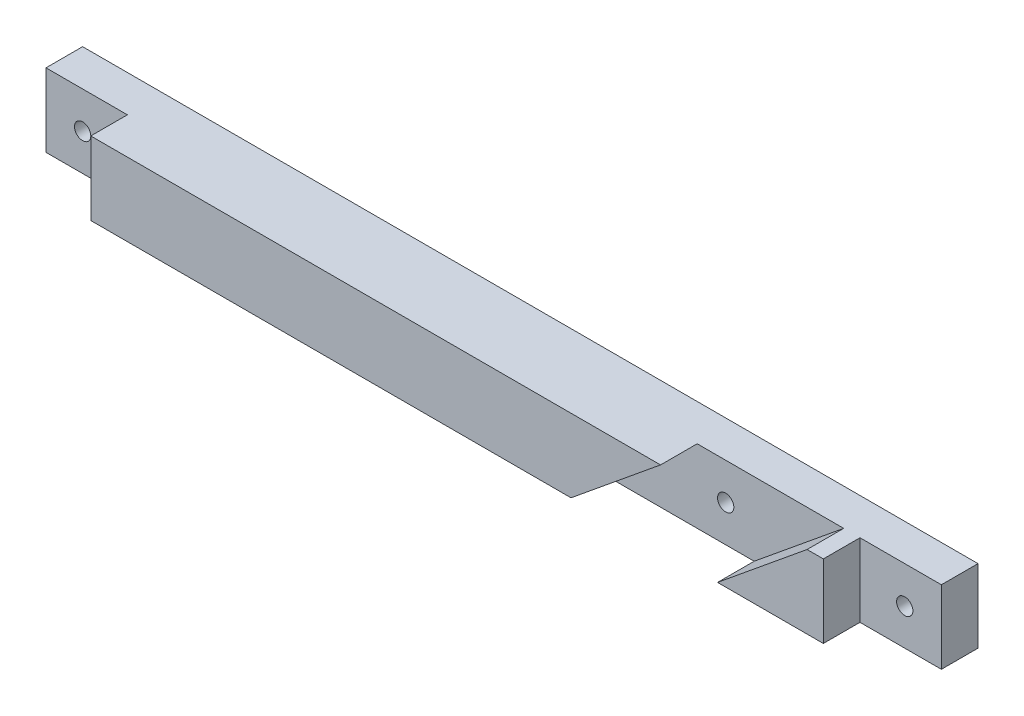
ISO-10303-21;
HEADER;
FILE_DESCRIPTION(('STEP AP214'),'2;1');
FILE_NAME('part.step','',(''),(''),'','','');
FILE_SCHEMA(('AUTOMOTIVE_DESIGN { 1 0 10303 214 1 1 1 1 }'));
ENDSEC;
DATA;
#1=APPLICATION_CONTEXT('core data for automotive mechanical design processes');
#2=APPLICATION_PROTOCOL_DEFINITION('international standard','automotive_design',2000,#1);
#3=PRODUCT_CONTEXT('',#1,'mechanical');
#4=PRODUCT('Part','Part','',(#3));
#5=PRODUCT_RELATED_PRODUCT_CATEGORY('part','',(#4));
#6=PRODUCT_DEFINITION_FORMATION('','',#4);
#7=PRODUCT_DEFINITION_CONTEXT('part definition',#1,'design');
#8=PRODUCT_DEFINITION('design','',#6,#7);
#9=PRODUCT_DEFINITION_SHAPE('','',#8);
#10=(LENGTH_UNIT() NAMED_UNIT(*) SI_UNIT(.MILLI.,.METRE.));
#11=(NAMED_UNIT(*) PLANE_ANGLE_UNIT() SI_UNIT($,.RADIAN.));
#12=(NAMED_UNIT(*) SI_UNIT($,.STERADIAN.) SOLID_ANGLE_UNIT());
#13=UNCERTAINTY_MEASURE_WITH_UNIT(LENGTH_MEASURE(1.E-05),#10,'distance_accuracy_value','');
#14=(GEOMETRIC_REPRESENTATION_CONTEXT(3) GLOBAL_UNCERTAINTY_ASSIGNED_CONTEXT((#13)) GLOBAL_UNIT_ASSIGNED_CONTEXT((#10,
#11,#12)) REPRESENTATION_CONTEXT('',''));
#15=CARTESIAN_POINT('',(0.,0.,0.));
#16=DIRECTION('',(0.,0.,1.));
#17=DIRECTION('',(1.,0.,0.));
#18=AXIS2_PLACEMENT_3D('',#15,#16,#17);
#19=CARTESIAN_POINT('',(-67.2716845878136,-100.617562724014,9.));
#20=DIRECTION('',(0.,0.,-1.));
#21=DIRECTION('',(-1.,0.,0.));
#22=AXIS2_PLACEMENT_3D('',#19,#20,#21);
#23=PLANE('',#22);
#24=DIRECTION('',(1.,0.,0.));
#25=VECTOR('',#24,1.);
#26=CARTESIAN_POINT('',(-67.2716845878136,-109.617562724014,9.));
#27=LINE('',#26,#25);
#28=CARTESIAN_POINT('',(-57.2716845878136,-109.617562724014,9.));
#29=VERTEX_POINT('',#28);
#30=CARTESIAN_POINT('',(1.72831541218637,-109.617562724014,9.));
#31=VERTEX_POINT('',#30);
#32=EDGE_CURVE('E205',#29,#31,#27,.T.);
#33=ORIENTED_EDGE('',*,*,#32,.T.);
#34=DIRECTION('',(-0.773957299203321,-0.633237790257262,0.));
#35=VECTOR('',#34,1.);
#36=CARTESIAN_POINT('',(1.72831541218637,-109.617562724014,9.));
#37=LINE('',#36,#35);
#38=CARTESIAN_POINT('',(12.7283154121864,-100.617562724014,9.));
#39=VERTEX_POINT('',#38);
#40=EDGE_CURVE('E125',#39,#31,#37,.T.);
#41=ORIENTED_EDGE('',*,*,#40,.F.);
#42=DIRECTION('',(-1.,0.,0.));
#43=VECTOR('',#42,1.);
#44=CARTESIAN_POINT('',(-67.2716845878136,-100.617562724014,9.));
#45=LINE('',#44,#43);
#46=CARTESIAN_POINT('',(-57.2716845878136,-100.617562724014,9.));
#47=VERTEX_POINT('',#46);
#48=EDGE_CURVE('E207',#39,#47,#45,.T.);
#49=ORIENTED_EDGE('',*,*,#48,.T.);
#50=DIRECTION('',(0.,1.,0.));
#51=VECTOR('',#50,1.);
#52=CARTESIAN_POINT('',(-57.2716845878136,-109.617562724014,9.));
#53=LINE('',#52,#51);
#54=EDGE_CURVE('E185',#29,#47,#53,.T.);
#55=ORIENTED_EDGE('',*,*,#54,.F.);
#56=EDGE_LOOP('',(#33,#41,#49,#55));
#57=FACE_BOUND('',#56,.T.);
#58=ADVANCED_FACE('F31',(#57),#23,.F.);
#59=CARTESIAN_POINT('',(42.7283154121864,-109.617562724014,9.));
#60=DIRECTION('',(-1.,0.,0.));
#61=DIRECTION('',(0.,0.,1.));
#62=AXIS2_PLACEMENT_3D('',#59,#60,#61);
#63=PLANE('',#62);
#64=DIRECTION('',(0.,1.,0.));
#65=VECTOR('',#64,1.);
#66=CARTESIAN_POINT('',(42.7283154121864,-109.617562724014,4.5));
#67=LINE('',#66,#65);
#68=CARTESIAN_POINT('',(42.7283154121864,-109.617562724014,4.5));
#69=VERTEX_POINT('',#68);
#70=CARTESIAN_POINT('',(42.7283154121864,-100.617562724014,4.5));
#71=VERTEX_POINT('',#70);
#72=EDGE_CURVE('E171',#69,#71,#67,.T.);
#73=ORIENTED_EDGE('',*,*,#72,.F.);
#74=DIRECTION('',(0.,0.,-1.));
#75=VECTOR('',#74,1.);
#76=CARTESIAN_POINT('',(42.7283154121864,-109.617562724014,9.));
#77=LINE('',#76,#75);
#78=CARTESIAN_POINT('',(42.7283154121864,-109.617562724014,0.));
#79=VERTEX_POINT('',#78);
#80=EDGE_CURVE('E39',#69,#79,#77,.T.);
#81=ORIENTED_EDGE('',*,*,#80,.T.);
#82=DIRECTION('',(0.,1.,0.));
#83=VECTOR('',#82,1.);
#84=CARTESIAN_POINT('',(42.7283154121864,-109.617562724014,0.));
#85=LINE('',#84,#83);
#86=CARTESIAN_POINT('',(42.7283154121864,-100.617562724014,0.));
#87=VERTEX_POINT('',#86);
#88=EDGE_CURVE('E218',#79,#87,#85,.T.);
#89=ORIENTED_EDGE('',*,*,#88,.T.);
#90=DIRECTION('',(0.,0.,-1.));
#91=VECTOR('',#90,1.);
#92=CARTESIAN_POINT('',(42.7283154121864,-100.617562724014,9.));
#93=LINE('',#92,#91);
#94=EDGE_CURVE('E225',#71,#87,#93,.T.);
#95=ORIENTED_EDGE('',*,*,#94,.F.);
#96=EDGE_LOOP('',(#73,#81,#89,#95));
#97=FACE_BOUND('',#96,.T.);
#98=ADVANCED_FACE('F229',(#97),#63,.F.);
#99=CARTESIAN_POINT('',(-67.2716845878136,-109.617562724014,9.));
#100=DIRECTION('',(1.,0.,0.));
#101=DIRECTION('',(0.,0.,-1.));
#102=AXIS2_PLACEMENT_3D('',#99,#100,#101);
#103=PLANE('',#102);
#104=DIRECTION('',(0.,0.,-1.));
#105=VECTOR('',#104,1.);
#106=CARTESIAN_POINT('',(-67.2716845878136,-109.617562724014,9.));
#107=LINE('',#106,#105);
#108=CARTESIAN_POINT('',(-67.2716845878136,-109.617562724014,4.5));
#109=VERTEX_POINT('',#108);
#110=CARTESIAN_POINT('',(-67.2716845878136,-109.617562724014,0.));
#111=VERTEX_POINT('',#110);
#112=EDGE_CURVE('E11',#109,#111,#107,.T.);
#113=ORIENTED_EDGE('',*,*,#112,.F.);
#114=DIRECTION('',(0.,-1.,0.));
#115=VECTOR('',#114,1.);
#116=CARTESIAN_POINT('',(-67.2716845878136,-109.617562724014,4.5));
#117=LINE('',#116,#115);
#118=CARTESIAN_POINT('',(-67.2716845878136,-100.617562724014,4.5));
#119=VERTEX_POINT('',#118);
#120=EDGE_CURVE('E187',#119,#109,#117,.T.);
#121=ORIENTED_EDGE('',*,*,#120,.F.);
#122=DIRECTION('',(0.,0.,-1.));
#123=VECTOR('',#122,1.);
#124=CARTESIAN_POINT('',(-67.2716845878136,-100.617562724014,9.));
#125=LINE('',#124,#123);
#126=CARTESIAN_POINT('',(-67.2716845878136,-100.617562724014,0.));
#127=VERTEX_POINT('',#126);
#128=EDGE_CURVE('E212',#119,#127,#125,.T.);
#129=ORIENTED_EDGE('',*,*,#128,.T.);
#130=DIRECTION('',(0.,-1.,0.));
#131=VECTOR('',#130,1.);
#132=CARTESIAN_POINT('',(-67.2716845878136,-109.617562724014,0.));
#133=LINE('',#132,#131);
#134=EDGE_CURVE('E203',#127,#111,#133,.T.);
#135=ORIENTED_EDGE('',*,*,#134,.T.);
#136=EDGE_LOOP('',(#113,#121,#129,#135));
#137=FACE_BOUND('',#136,.T.);
#138=ADVANCED_FACE('F33',(#137),#103,.F.);
#139=CARTESIAN_POINT('',(-67.2716845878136,-109.617562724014,9.));
#140=DIRECTION('',(0.,1.,0.));
#141=DIRECTION('',(0.,0.,1.));
#142=AXIS2_PLACEMENT_3D('',#139,#140,#141);
#143=PLANE('',#142);
#144=DIRECTION('',(1.,0.,0.));
#145=VECTOR('',#144,1.);
#146=CARTESIAN_POINT('',(19.7283154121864,-109.617562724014,4.5));
#147=LINE('',#146,#145);
#148=CARTESIAN_POINT('',(1.72831541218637,-109.617562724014,4.5));
#149=VERTEX_POINT('',#148);
#150=CARTESIAN_POINT('',(19.7283154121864,-109.617562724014,4.5));
#151=VERTEX_POINT('',#150);
#152=EDGE_CURVE('E136',#149,#151,#147,.T.);
#153=ORIENTED_EDGE('',*,*,#152,.F.);
#154=DIRECTION('',(0.,0.,1.));
#155=VECTOR('',#154,1.);
#156=CARTESIAN_POINT('',(1.72831541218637,-109.617562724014,4.5));
#157=LINE('',#156,#155);
#158=EDGE_CURVE('E119',#149,#31,#157,.T.);
#159=ORIENTED_EDGE('',*,*,#158,.T.);
#160=ORIENTED_EDGE('',*,*,#32,.F.);
#161=DIRECTION('',(0.,0.,1.));
#162=VECTOR('',#161,1.);
#163=CARTESIAN_POINT('',(-57.2716845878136,-109.617562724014,4.5));
#164=LINE('',#163,#162);
#165=CARTESIAN_POINT('',(-57.2716845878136,-109.617562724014,4.5));
#166=VERTEX_POINT('',#165);
#167=EDGE_CURVE('E197',#166,#29,#164,.T.);
#168=ORIENTED_EDGE('',*,*,#167,.F.);
#169=DIRECTION('',(1.,0.,0.));
#170=VECTOR('',#169,1.);
#171=CARTESIAN_POINT('',(-67.2716845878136,-109.617562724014,4.5));
#172=LINE('',#171,#170);
#173=EDGE_CURVE('E189',#109,#166,#172,.T.);
#174=ORIENTED_EDGE('',*,*,#173,.F.);
#175=ORIENTED_EDGE('',*,*,#112,.T.);
#176=DIRECTION('',(1.,0.,0.));
#177=VECTOR('',#176,1.);
#178=CARTESIAN_POINT('',(-67.2716845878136,-109.617562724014,0.));
#179=LINE('',#178,#177);
#180=EDGE_CURVE('E215',#111,#79,#179,.T.);
#181=ORIENTED_EDGE('',*,*,#180,.T.);
#182=ORIENTED_EDGE('',*,*,#80,.F.);
#183=DIRECTION('',(1.,0.,0.));
#184=VECTOR('',#183,1.);
#185=CARTESIAN_POINT('',(42.7283154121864,-109.617562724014,4.5));
#186=LINE('',#185,#184);
#187=CARTESIAN_POINT('',(32.7283154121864,-109.617562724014,4.5));
#188=VERTEX_POINT('',#187);
#189=EDGE_CURVE('E179',#188,#69,#186,.T.);
#190=ORIENTED_EDGE('',*,*,#189,.F.);
#191=DIRECTION('',(0.,0.,1.));
#192=VECTOR('',#191,1.);
#193=CARTESIAN_POINT('',(32.7283154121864,-109.617562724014,4.5));
#194=LINE('',#193,#192);
#195=CARTESIAN_POINT('',(32.7283154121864,-109.617562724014,9.));
#196=VERTEX_POINT('',#195);
#197=EDGE_CURVE('E182',#188,#196,#194,.T.);
#198=ORIENTED_EDGE('',*,*,#197,.T.);
#199=CARTESIAN_POINT('',(19.7283154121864,-109.617562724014,9.));
#200=VERTEX_POINT('',#199);
#201=EDGE_CURVE('E208',#200,#196,#27,.T.);
#202=ORIENTED_EDGE('',*,*,#201,.F.);
#203=DIRECTION('',(0.,0.,1.));
#204=VECTOR('',#203,1.);
#205=CARTESIAN_POINT('',(19.7283154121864,-109.617562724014,4.5));
#206=LINE('',#205,#204);
#207=EDGE_CURVE('E46',#151,#200,#206,.T.);
#208=ORIENTED_EDGE('',*,*,#207,.F.);
#209=EDGE_LOOP('',(#153,#159,#160,#168,#174,#175,#181,#182,#190,#198,#202,#208));
#210=FACE_BOUND('',#209,.T.);
#211=ADVANCED_FACE('F141',(#210),#143,.F.);
#212=CARTESIAN_POINT('',(-67.2716845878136,-100.617562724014,9.));
#213=DIRECTION('',(0.,-1.,0.));
#214=DIRECTION('',(0.,0.,-1.));
#215=AXIS2_PLACEMENT_3D('',#212,#213,#214);
#216=PLANE('',#215);
#217=ORIENTED_EDGE('',*,*,#48,.F.);
#218=DIRECTION('',(0.,0.,1.));
#219=VECTOR('',#218,1.);
#220=CARTESIAN_POINT('',(12.7283154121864,-100.617562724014,4.5));
#221=LINE('',#220,#219);
#222=CARTESIAN_POINT('',(12.7283154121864,-100.617562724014,4.5));
#223=VERTEX_POINT('',#222);
#224=EDGE_CURVE('E152',#223,#39,#221,.T.);
#225=ORIENTED_EDGE('',*,*,#224,.F.);
#226=DIRECTION('',(-1.,0.,0.));
#227=VECTOR('',#226,1.);
#228=CARTESIAN_POINT('',(12.7283154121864,-100.617562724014,4.5));
#229=LINE('',#228,#227);
#230=CARTESIAN_POINT('',(30.7283154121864,-100.617562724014,4.5));
#231=VERTEX_POINT('',#230);
#232=EDGE_CURVE('E130',#231,#223,#229,.T.);
#233=ORIENTED_EDGE('',*,*,#232,.F.);
#234=DIRECTION('',(0.,0.,1.));
#235=VECTOR('',#234,1.);
#236=CARTESIAN_POINT('',(30.7283154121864,-100.617562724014,4.5));
#237=LINE('',#236,#235);
#238=CARTESIAN_POINT('',(30.7283154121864,-100.617562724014,9.));
#239=VERTEX_POINT('',#238);
#240=EDGE_CURVE('E155',#231,#239,#237,.T.);
#241=ORIENTED_EDGE('',*,*,#240,.T.);
#242=CARTESIAN_POINT('',(32.7283154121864,-100.617562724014,9.));
#243=VERTEX_POINT('',#242);
#244=EDGE_CURVE('E209',#243,#239,#45,.T.);
#245=ORIENTED_EDGE('',*,*,#244,.F.);
#246=DIRECTION('',(0.,0.,1.));
#247=VECTOR('',#246,1.);
#248=CARTESIAN_POINT('',(32.7283154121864,-100.617562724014,4.5));
#249=LINE('',#248,#247);
#250=CARTESIAN_POINT('',(32.7283154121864,-100.617562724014,4.5));
#251=VERTEX_POINT('',#250);
#252=EDGE_CURVE('E54',#251,#243,#249,.T.);
#253=ORIENTED_EDGE('',*,*,#252,.F.);
#254=DIRECTION('',(-1.,0.,0.));
#255=VECTOR('',#254,1.);
#256=CARTESIAN_POINT('',(42.7283154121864,-100.617562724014,4.5));
#257=LINE('',#256,#255);
#258=EDGE_CURVE('E173',#71,#251,#257,.T.);
#259=ORIENTED_EDGE('',*,*,#258,.F.);
#260=ORIENTED_EDGE('',*,*,#94,.T.);
#261=DIRECTION('',(-1.,0.,0.));
#262=VECTOR('',#261,1.);
#263=CARTESIAN_POINT('',(-67.2716845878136,-100.617562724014,0.));
#264=LINE('',#263,#262);
#265=EDGE_CURVE('E221',#87,#127,#264,.T.);
#266=ORIENTED_EDGE('',*,*,#265,.T.);
#267=ORIENTED_EDGE('',*,*,#128,.F.);
#268=DIRECTION('',(-1.,0.,0.));
#269=VECTOR('',#268,1.);
#270=CARTESIAN_POINT('',(-67.2716845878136,-100.617562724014,4.5));
#271=LINE('',#270,#269);
#272=CARTESIAN_POINT('',(-57.2716845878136,-100.617562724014,4.5));
#273=VERTEX_POINT('',#272);
#274=EDGE_CURVE('E195',#273,#119,#271,.T.);
#275=ORIENTED_EDGE('',*,*,#274,.F.);
#276=DIRECTION('',(0.,0.,1.));
#277=VECTOR('',#276,1.);
#278=CARTESIAN_POINT('',(-57.2716845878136,-100.617562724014,4.5));
#279=LINE('',#278,#277);
#280=EDGE_CURVE('E200',#273,#47,#279,.T.);
#281=ORIENTED_EDGE('',*,*,#280,.T.);
#282=EDGE_LOOP('',(#217,#225,#233,#241,#245,#253,#259,#260,#266,#267,#275,#281));
#283=FACE_BOUND('',#282,.T.);
#284=ADVANCED_FACE('F243',(#283),#216,.F.);
#285=ORIENTED_EDGE('',*,*,#244,.T.);
#286=DIRECTION('',(0.773957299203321,0.633237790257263,0.));
#287=VECTOR('',#286,1.);
#288=CARTESIAN_POINT('',(30.7283154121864,-100.617562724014,9.));
#289=LINE('',#288,#287);
#290=EDGE_CURVE('E139',#200,#239,#289,.T.);
#291=ORIENTED_EDGE('',*,*,#290,.F.);
#292=ORIENTED_EDGE('',*,*,#201,.T.);
#293=DIRECTION('',(0.,-1.,0.));
#294=VECTOR('',#293,1.);
#295=CARTESIAN_POINT('',(32.7283154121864,-109.617562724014,9.));
#296=LINE('',#295,#294);
#297=EDGE_CURVE('E168',#243,#196,#296,.T.);
#298=ORIENTED_EDGE('',*,*,#297,.F.);
#299=EDGE_LOOP('',(#285,#291,#292,#298));
#300=FACE_BOUND('',#299,.T.);
#301=ADVANCED_FACE('F251',(#300),#23,.F.);
#302=CARTESIAN_POINT('',(-67.2716845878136,-100.617562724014,0.));
#303=DIRECTION('',(0.,0.,-1.));
#304=DIRECTION('',(-1.,0.,0.));
#305=AXIS2_PLACEMENT_3D('',#302,#303,#304);
#306=PLANE('',#305);
#307=CARTESIAN_POINT('',(16.2283154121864,-105.117562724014,0.));
#308=DIRECTION('',(0.,0.,1.));
#309=DIRECTION('',(1.,0.,0.));
#310=AXIS2_PLACEMENT_3D('',#307,#308,#309);
#311=CIRCLE('',#310,1.);
#312=CARTESIAN_POINT('',(17.2283154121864,-105.117562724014,0.));
#313=VERTEX_POINT('',#312);
#314=EDGE_CURVE('E150',#313,#313,#311,.T.);
#315=ORIENTED_EDGE('',*,*,#314,.T.);
#316=EDGE_LOOP('',(#315));
#317=FACE_BOUND('',#316,.T.);
#318=CARTESIAN_POINT('',(-62.7716845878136,-105.117562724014,0.));
#319=DIRECTION('',(0.,0.,1.));
#320=DIRECTION('',(1.,0.,0.));
#321=AXIS2_PLACEMENT_3D('',#318,#319,#320);
#322=CIRCLE('',#321,0.999999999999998);
#323=CARTESIAN_POINT('',(-61.7716845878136,-105.117562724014,0.));
#324=VERTEX_POINT('',#323);
#325=EDGE_CURVE('E159',#324,#324,#322,.T.);
#326=ORIENTED_EDGE('',*,*,#325,.T.);
#327=EDGE_LOOP('',(#326));
#328=FACE_BOUND('',#327,.T.);
#329=CARTESIAN_POINT('',(38.2284017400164,-105.145436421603,0.));
#330=DIRECTION('',(0.,0.,1.));
#331=DIRECTION('',(1.,0.,0.));
#332=AXIS2_PLACEMENT_3D('',#329,#330,#331);
#333=CIRCLE('',#332,0.999999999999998);
#334=CARTESIAN_POINT('',(39.2284017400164,-105.145436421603,0.));
#335=VERTEX_POINT('',#334);
#336=EDGE_CURVE('E165',#335,#335,#333,.T.);
#337=ORIENTED_EDGE('',*,*,#336,.T.);
#338=EDGE_LOOP('',(#337));
#339=FACE_BOUND('',#338,.T.);
#340=ORIENTED_EDGE('',*,*,#134,.F.);
#341=ORIENTED_EDGE('',*,*,#265,.F.);
#342=ORIENTED_EDGE('',*,*,#88,.F.);
#343=ORIENTED_EDGE('',*,*,#180,.F.);
#344=EDGE_LOOP('',(#340,#341,#342,#343));
#345=FACE_BOUND('',#344,.T.);
#346=ADVANCED_FACE('F239',(#317,#328,#339,#345),#306,.T.);
#347=CARTESIAN_POINT('',(-57.2716845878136,-109.617562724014,4.5));
#348=DIRECTION('',(1.,0.,0.));
#349=DIRECTION('',(0.,1.,0.));
#350=AXIS2_PLACEMENT_3D('',#347,#348,#349);
#351=PLANE('',#350);
#352=ORIENTED_EDGE('',*,*,#54,.T.);
#353=ORIENTED_EDGE('',*,*,#280,.F.);
#354=DIRECTION('',(0.,1.,0.));
#355=VECTOR('',#354,1.);
#356=CARTESIAN_POINT('',(-57.2716845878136,-109.617562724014,4.5));
#357=LINE('',#356,#355);
#358=EDGE_CURVE('E192',#166,#273,#357,.T.);
#359=ORIENTED_EDGE('',*,*,#358,.F.);
#360=ORIENTED_EDGE('',*,*,#167,.T.);
#361=EDGE_LOOP('',(#352,#353,#359,#360));
#362=FACE_BOUND('',#361,.T.);
#363=ADVANCED_FACE('F278',(#362),#351,.F.);
#364=CARTESIAN_POINT('',(-67.2716845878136,-100.617562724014,4.5));
#365=DIRECTION('',(0.,0.,-1.));
#366=DIRECTION('',(-1.,0.,0.));
#367=AXIS2_PLACEMENT_3D('',#364,#365,#366);
#368=PLANE('',#367);
#369=CARTESIAN_POINT('',(-62.7716845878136,-105.117562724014,4.5));
#370=DIRECTION('',(0.,0.,1.));
#371=DIRECTION('',(1.,0.,0.));
#372=AXIS2_PLACEMENT_3D('',#369,#370,#371);
#373=CIRCLE('',#372,0.999999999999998);
#374=CARTESIAN_POINT('',(-61.7716845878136,-105.117562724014,4.5));
#375=VERTEX_POINT('',#374);
#376=EDGE_CURVE('E154',#375,#375,#373,.T.);
#377=ORIENTED_EDGE('',*,*,#376,.F.);
#378=EDGE_LOOP('',(#377));
#379=FACE_BOUND('',#378,.T.);
#380=ORIENTED_EDGE('',*,*,#120,.T.);
#381=ORIENTED_EDGE('',*,*,#173,.T.);
#382=ORIENTED_EDGE('',*,*,#358,.T.);
#383=ORIENTED_EDGE('',*,*,#274,.T.);
#384=EDGE_LOOP('',(#380,#381,#382,#383));
#385=FACE_BOUND('',#384,.T.);
#386=ADVANCED_FACE('F292',(#379,#385),#368,.F.);
#387=CARTESIAN_POINT('',(32.7283154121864,-109.617562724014,4.5));
#388=DIRECTION('',(-1.,0.,0.));
#389=DIRECTION('',(0.,0.,1.));
#390=AXIS2_PLACEMENT_3D('',#387,#388,#389);
#391=PLANE('',#390);
#392=ORIENTED_EDGE('',*,*,#297,.T.);
#393=ORIENTED_EDGE('',*,*,#197,.F.);
#394=DIRECTION('',(0.,-1.,0.));
#395=VECTOR('',#394,1.);
#396=CARTESIAN_POINT('',(32.7283154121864,-109.617562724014,4.5));
#397=LINE('',#396,#395);
#398=EDGE_CURVE('E176',#251,#188,#397,.T.);
#399=ORIENTED_EDGE('',*,*,#398,.F.);
#400=ORIENTED_EDGE('',*,*,#252,.T.);
#401=EDGE_LOOP('',(#392,#393,#399,#400));
#402=FACE_BOUND('',#401,.T.);
#403=ADVANCED_FACE('F249',(#402),#391,.F.);
#404=CARTESIAN_POINT('',(42.7283154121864,-100.617562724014,4.5));
#405=DIRECTION('',(0.,0.,1.));
#406=DIRECTION('',(1.,0.,0.));
#407=AXIS2_PLACEMENT_3D('',#404,#405,#406);
#408=PLANE('',#407);
#409=CARTESIAN_POINT('',(38.2284017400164,-105.145436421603,4.5));
#410=DIRECTION('',(0.,0.,1.));
#411=DIRECTION('',(1.,0.,0.));
#412=AXIS2_PLACEMENT_3D('',#409,#410,#411);
#413=CIRCLE('',#412,0.999999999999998);
#414=CARTESIAN_POINT('',(39.2284017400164,-105.145436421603,4.5));
#415=VERTEX_POINT('',#414);
#416=EDGE_CURVE('E162',#415,#415,#413,.T.);
#417=ORIENTED_EDGE('',*,*,#416,.F.);
#418=EDGE_LOOP('',(#417));
#419=FACE_BOUND('',#418,.T.);
#420=ORIENTED_EDGE('',*,*,#72,.T.);
#421=ORIENTED_EDGE('',*,*,#258,.T.);
#422=ORIENTED_EDGE('',*,*,#398,.T.);
#423=ORIENTED_EDGE('',*,*,#189,.T.);
#424=EDGE_LOOP('',(#420,#421,#422,#423));
#425=FACE_BOUND('',#424,.T.);
#426=ADVANCED_FACE('F248',(#419,#425),#408,.T.);
#427=CARTESIAN_POINT('',(38.2284017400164,-105.145436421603,0.));
#428=DIRECTION('',(0.,0.,1.));
#429=DIRECTION('',(1.,0.,0.));
#430=AXIS2_PLACEMENT_3D('',#427,#428,#429);
#431=CYLINDRICAL_SURFACE('',#430,0.999999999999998);
#432=ORIENTED_EDGE('',*,*,#336,.F.);
#433=EDGE_LOOP('',(#432));
#434=FACE_BOUND('',#433,.T.);
#435=ORIENTED_EDGE('',*,*,#416,.T.);
#436=EDGE_LOOP('',(#435));
#437=FACE_BOUND('',#436,.T.);
#438=ADVANCED_FACE('F307',(#434,#437),#431,.F.);
#439=CARTESIAN_POINT('',(-62.7716845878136,-105.117562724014,0.));
#440=DIRECTION('',(0.,0.,1.));
#441=DIRECTION('',(1.,0.,0.));
#442=AXIS2_PLACEMENT_3D('',#439,#440,#441);
#443=CYLINDRICAL_SURFACE('',#442,0.999999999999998);
#444=ORIENTED_EDGE('',*,*,#325,.F.);
#445=EDGE_LOOP('',(#444));
#446=FACE_BOUND('',#445,.T.);
#447=ORIENTED_EDGE('',*,*,#376,.T.);
#448=EDGE_LOOP('',(#447));
#449=FACE_BOUND('',#448,.T.);
#450=ADVANCED_FACE('F262',(#446,#449),#443,.F.);
#451=CARTESIAN_POINT('',(1.72831541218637,-109.617562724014,4.5));
#452=DIRECTION('',(-0.633237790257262,0.773957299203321,0.));
#453=DIRECTION('',(-0.773957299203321,-0.633237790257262,0.));
#454=AXIS2_PLACEMENT_3D('',#451,#452,#453);
#455=PLANE('',#454);
#456=ORIENTED_EDGE('',*,*,#40,.T.);
#457=ORIENTED_EDGE('',*,*,#158,.F.);
#458=DIRECTION('',(-0.773957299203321,-0.633237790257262,0.));
#459=VECTOR('',#458,1.);
#460=CARTESIAN_POINT('',(1.72831541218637,-109.617562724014,4.5));
#461=LINE('',#460,#459);
#462=EDGE_CURVE('E122',#223,#149,#461,.T.);
#463=ORIENTED_EDGE('',*,*,#462,.F.);
#464=ORIENTED_EDGE('',*,*,#224,.T.);
#465=EDGE_LOOP('',(#456,#457,#463,#464));
#466=FACE_BOUND('',#465,.T.);
#467=ADVANCED_FACE('F121',(#466),#455,.F.);
#468=CARTESIAN_POINT('',(30.7283154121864,-100.617562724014,4.5));
#469=DIRECTION('',(0.633237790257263,-0.773957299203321,0.));
#470=DIRECTION('',(0.773957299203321,0.633237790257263,0.));
#471=AXIS2_PLACEMENT_3D('',#468,#469,#470);
#472=PLANE('',#471);
#473=ORIENTED_EDGE('',*,*,#290,.T.);
#474=ORIENTED_EDGE('',*,*,#240,.F.);
#475=DIRECTION('',(0.773957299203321,0.633237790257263,0.));
#476=VECTOR('',#475,1.);
#477=CARTESIAN_POINT('',(30.7283154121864,-100.617562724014,4.5));
#478=LINE('',#477,#476);
#479=EDGE_CURVE('E143',#151,#231,#478,.T.);
#480=ORIENTED_EDGE('',*,*,#479,.F.);
#481=ORIENTED_EDGE('',*,*,#207,.T.);
#482=EDGE_LOOP('',(#473,#474,#480,#481));
#483=FACE_BOUND('',#482,.T.);
#484=ADVANCED_FACE('F252',(#483),#472,.F.);
#485=CARTESIAN_POINT('',(1.72831541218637,-109.617562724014,4.5));
#486=DIRECTION('',(0.,0.,1.));
#487=DIRECTION('',(1.,0.,0.));
#488=AXIS2_PLACEMENT_3D('',#485,#486,#487);
#489=PLANE('',#488);
#490=CARTESIAN_POINT('',(16.2283154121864,-105.117562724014,4.5));
#491=DIRECTION('',(0.,0.,1.));
#492=DIRECTION('',(1.,0.,0.));
#493=AXIS2_PLACEMENT_3D('',#490,#491,#492);
#494=CIRCLE('',#493,1.);
#495=CARTESIAN_POINT('',(17.2283154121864,-105.117562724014,4.5));
#496=VERTEX_POINT('',#495);
#497=EDGE_CURVE('E369',#496,#496,#494,.T.);
#498=ORIENTED_EDGE('',*,*,#497,.F.);
#499=EDGE_LOOP('',(#498));
#500=FACE_BOUND('',#499,.T.);
#501=ORIENTED_EDGE('',*,*,#462,.T.);
#502=ORIENTED_EDGE('',*,*,#152,.T.);
#503=ORIENTED_EDGE('',*,*,#479,.T.);
#504=ORIENTED_EDGE('',*,*,#232,.T.);
#505=EDGE_LOOP('',(#501,#502,#503,#504));
#506=FACE_BOUND('',#505,.T.);
#507=ADVANCED_FACE('F134',(#500,#506),#489,.T.);
#508=CARTESIAN_POINT('',(16.2283154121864,-105.117562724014,0.));
#509=DIRECTION('',(0.,0.,1.));
#510=DIRECTION('',(1.,0.,0.));
#511=AXIS2_PLACEMENT_3D('',#508,#509,#510);
#512=CYLINDRICAL_SURFACE('',#511,1.);
#513=ORIENTED_EDGE('',*,*,#314,.F.);
#514=EDGE_LOOP('',(#513));
#515=FACE_BOUND('',#514,.T.);
#516=ORIENTED_EDGE('',*,*,#497,.T.);
#517=EDGE_LOOP('',(#516));
#518=FACE_BOUND('',#517,.T.);
#519=ADVANCED_FACE('F259',(#515,#518),#512,.F.);
#520=CLOSED_SHELL('',(#58,#98,#138,#211,#284,#301,#346,#363,#386,#403,#426,#438,#450,#467,#484,
#507,#519));
#521=MANIFOLD_SOLID_BREP('B2',#520);
#522=ADVANCED_BREP_SHAPE_REPRESENTATION('',(#18,#521),#14);
#523=SHAPE_DEFINITION_REPRESENTATION(#9,#522);
ENDSEC;
END-ISO-10303-21;
